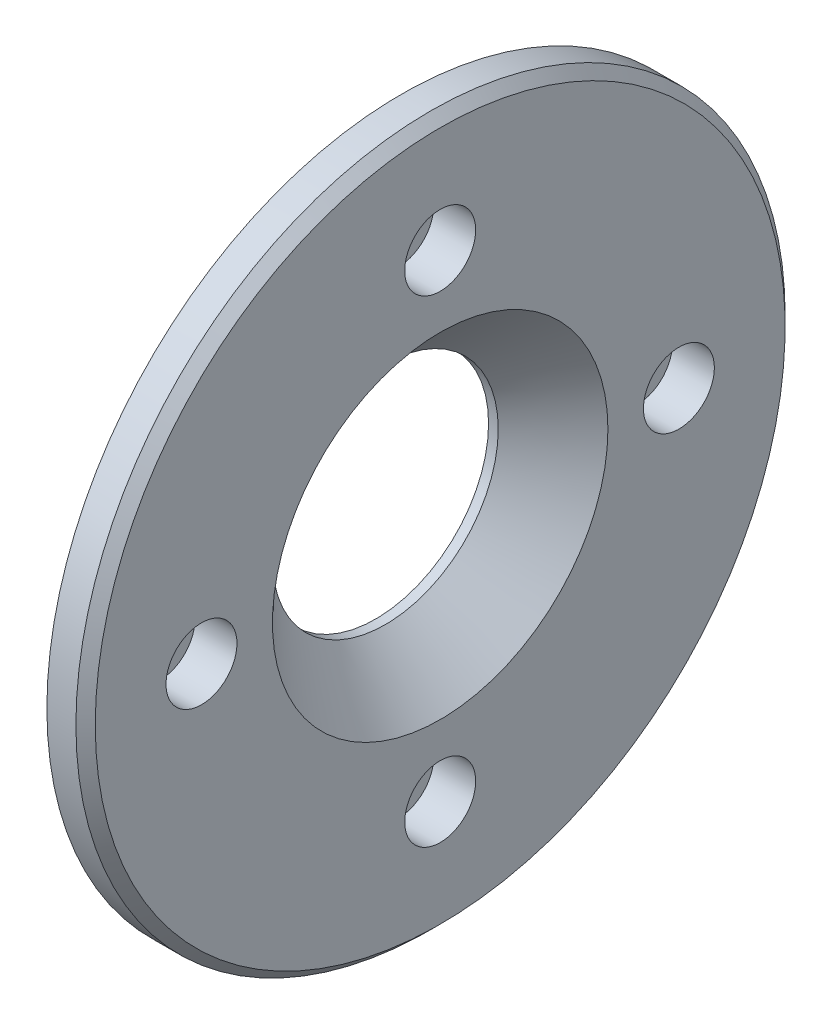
ISO-10303-21;
HEADER;
FILE_DESCRIPTION(('STEP AP214'),'2;1');
FILE_NAME('part.step','',(''),(''),'','','');
FILE_SCHEMA(('AUTOMOTIVE_DESIGN { 1 0 10303 214 1 1 1 1 }'));
ENDSEC;
DATA;
#1=APPLICATION_CONTEXT('core data for automotive mechanical design processes');
#2=APPLICATION_PROTOCOL_DEFINITION('international standard','automotive_design',2000,#1);
#3=PRODUCT_CONTEXT('',#1,'mechanical');
#4=PRODUCT('Part','Part','',(#3));
#5=PRODUCT_RELATED_PRODUCT_CATEGORY('part','',(#4));
#6=PRODUCT_DEFINITION_FORMATION('','',#4);
#7=PRODUCT_DEFINITION_CONTEXT('part definition',#1,'design');
#8=PRODUCT_DEFINITION('design','',#6,#7);
#9=PRODUCT_DEFINITION_SHAPE('','',#8);
#10=(LENGTH_UNIT() NAMED_UNIT(*) SI_UNIT(.MILLI.,.METRE.));
#11=(NAMED_UNIT(*) PLANE_ANGLE_UNIT() SI_UNIT($,.RADIAN.));
#12=(NAMED_UNIT(*) SI_UNIT($,.STERADIAN.) SOLID_ANGLE_UNIT());
#13=UNCERTAINTY_MEASURE_WITH_UNIT(LENGTH_MEASURE(1.E-05),#10,'distance_accuracy_value','');
#14=(GEOMETRIC_REPRESENTATION_CONTEXT(3) GLOBAL_UNCERTAINTY_ASSIGNED_CONTEXT((#13)) GLOBAL_UNIT_ASSIGNED_CONTEXT((#10,
#11,#12)) REPRESENTATION_CONTEXT('',''));
#15=CARTESIAN_POINT('',(0.,0.,0.));
#16=DIRECTION('',(0.,0.,1.));
#17=DIRECTION('',(1.,0.,0.));
#18=AXIS2_PLACEMENT_3D('',#15,#16,#17);
#19=CARTESIAN_POINT('',(1.99999999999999,0.,0.));
#20=DIRECTION('',(1.,0.,0.));
#21=DIRECTION('',(0.,0.,-1.));
#22=AXIS2_PLACEMENT_3D('',#19,#20,#21);
#23=CYLINDRICAL_SURFACE('',#22,44.9685);
#24=CARTESIAN_POINT('',(0.,0.,0.));
#25=DIRECTION('',(1.,0.,0.));
#26=DIRECTION('',(0.,0.,-1.));
#27=AXIS2_PLACEMENT_3D('',#24,#25,#26);
#28=CIRCLE('',#27,44.9685);
#29=CARTESIAN_POINT('',(0.,0.,-44.9685));
#30=VERTEX_POINT('',#29);
#31=EDGE_CURVE('E87',#30,#30,#28,.F.);
#32=ORIENTED_EDGE('',*,*,#31,.F.);
#33=EDGE_LOOP('',(#32));
#34=FACE_BOUND('',#33,.T.);
#35=CARTESIAN_POINT('',(3.99999999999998,0.,0.));
#36=DIRECTION('',(1.,0.,0.));
#37=DIRECTION('',(0.,0.,-1.));
#38=AXIS2_PLACEMENT_3D('',#35,#36,#37);
#39=CIRCLE('',#38,44.9685);
#40=CARTESIAN_POINT('',(3.99999999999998,0.,-44.9685));
#41=VERTEX_POINT('',#40);
#42=EDGE_CURVE('E18',#41,#41,#39,.T.);
#43=ORIENTED_EDGE('',*,*,#42,.F.);
#44=EDGE_LOOP('',(#43));
#45=FACE_BOUND('',#44,.T.);
#46=ADVANCED_FACE('F15',(#34,#45),#23,.T.);
#47=CARTESIAN_POINT('',(3.99999999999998,49.9685,0.));
#48=DIRECTION('',(-1.,0.,0.));
#49=DIRECTION('',(0.,0.,1.));
#50=AXIS2_PLACEMENT_3D('',#47,#48,#49);
#51=PLANE('',#50);
#52=ORIENTED_EDGE('',*,*,#42,.T.);
#53=EDGE_LOOP('',(#52));
#54=FACE_BOUND('',#53,.T.);
#55=CARTESIAN_POINT('',(3.99999999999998,0.,0.));
#56=DIRECTION('',(1.,0.,0.));
#57=DIRECTION('',(0.,0.,-1.));
#58=AXIS2_PLACEMENT_3D('',#55,#56,#57);
#59=CIRCLE('',#58,54.9685);
#60=CARTESIAN_POINT('',(3.99999999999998,0.,-54.9685));
#61=VERTEX_POINT('',#60);
#62=EDGE_CURVE('E73',#61,#61,#59,.T.);
#63=ORIENTED_EDGE('',*,*,#62,.F.);
#64=EDGE_LOOP('',(#63));
#65=FACE_BOUND('',#64,.T.);
#66=ADVANCED_FACE('F94',(#54,#65),#51,.T.);
#67=CARTESIAN_POINT('',(-145.795660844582,0.,37.));
#68=DIRECTION('',(1.,0.,0.));
#69=DIRECTION('',(0.,0.,-1.));
#70=AXIS2_PLACEMENT_3D('',#67,#68,#69);
#71=CYLINDRICAL_SURFACE('',#70,3.25);
#72=CARTESIAN_POINT('',(3.49999999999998,0.,37.));
#73=DIRECTION('',(1.,0.,0.));
#74=DIRECTION('',(0.,0.,-1.));
#75=AXIS2_PLACEMENT_3D('',#72,#73,#74);
#76=CIRCLE('',#75,3.25);
#77=CARTESIAN_POINT('',(3.49999999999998,0.,33.75));
#78=VERTEX_POINT('',#77);
#79=EDGE_CURVE('E70',#78,#78,#76,.F.);
#80=ORIENTED_EDGE('',*,*,#79,.F.);
#81=EDGE_LOOP('',(#80));
#82=FACE_BOUND('',#81,.T.);
#83=CARTESIAN_POINT('',(0.,0.,37.));
#84=DIRECTION('',(1.,0.,0.));
#85=DIRECTION('',(0.,0.,-1.));
#86=AXIS2_PLACEMENT_3D('',#83,#84,#85);
#87=CIRCLE('',#86,3.25);
#88=CARTESIAN_POINT('',(0.,0.,33.75));
#89=VERTEX_POINT('',#88);
#90=EDGE_CURVE('E85',#89,#89,#87,.T.);
#91=ORIENTED_EDGE('',*,*,#90,.F.);
#92=EDGE_LOOP('',(#91));
#93=FACE_BOUND('',#92,.T.);
#94=ADVANCED_FACE('F103',(#82,#93),#71,.F.);
#95=CARTESIAN_POINT('',(-145.795660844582,0.,-37.));
#96=DIRECTION('',(1.,0.,0.));
#97=DIRECTION('',(0.,0.,-1.));
#98=AXIS2_PLACEMENT_3D('',#95,#96,#97);
#99=CYLINDRICAL_SURFACE('',#98,3.25);
#100=CARTESIAN_POINT('',(3.49999999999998,0.,-37.));
#101=DIRECTION('',(1.,0.,0.));
#102=DIRECTION('',(0.,0.,-1.));
#103=AXIS2_PLACEMENT_3D('',#100,#101,#102);
#104=CIRCLE('',#103,3.25);
#105=CARTESIAN_POINT('',(3.49999999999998,0.,-40.25));
#106=VERTEX_POINT('',#105);
#107=EDGE_CURVE('E67',#106,#106,#104,.F.);
#108=ORIENTED_EDGE('',*,*,#107,.F.);
#109=EDGE_LOOP('',(#108));
#110=FACE_BOUND('',#109,.T.);
#111=CARTESIAN_POINT('',(0.,0.,-37.));
#112=DIRECTION('',(1.,0.,0.));
#113=DIRECTION('',(0.,0.,-1.));
#114=AXIS2_PLACEMENT_3D('',#111,#112,#113);
#115=CIRCLE('',#114,3.25);
#116=CARTESIAN_POINT('',(0.,0.,-40.25));
#117=VERTEX_POINT('',#116);
#118=EDGE_CURVE('E82',#117,#117,#115,.T.);
#119=ORIENTED_EDGE('',*,*,#118,.F.);
#120=EDGE_LOOP('',(#119));
#121=FACE_BOUND('',#120,.T.);
#122=ADVANCED_FACE('F170',(#110,#121),#99,.F.);
#123=CARTESIAN_POINT('',(-145.795660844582,-37.,0.));
#124=DIRECTION('',(1.,0.,0.));
#125=DIRECTION('',(0.,0.,-1.));
#126=AXIS2_PLACEMENT_3D('',#123,#124,#125);
#127=CYLINDRICAL_SURFACE('',#126,3.25);
#128=CARTESIAN_POINT('',(3.49999999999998,-37.,0.));
#129=DIRECTION('',(1.,0.,0.));
#130=DIRECTION('',(0.,0.,-1.));
#131=AXIS2_PLACEMENT_3D('',#128,#129,#130);
#132=CIRCLE('',#131,3.25);
#133=CARTESIAN_POINT('',(3.49999999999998,-37.,-3.25));
#134=VERTEX_POINT('',#133);
#135=EDGE_CURVE('E64',#134,#134,#132,.F.);
#136=ORIENTED_EDGE('',*,*,#135,.F.);
#137=EDGE_LOOP('',(#136));
#138=FACE_BOUND('',#137,.T.);
#139=CARTESIAN_POINT('',(0.,-37.,0.));
#140=DIRECTION('',(1.,0.,0.));
#141=DIRECTION('',(0.,0.,-1.));
#142=AXIS2_PLACEMENT_3D('',#139,#140,#141);
#143=CIRCLE('',#142,3.25);
#144=CARTESIAN_POINT('',(0.,-37.,-3.25));
#145=VERTEX_POINT('',#144);
#146=EDGE_CURVE('E79',#145,#145,#143,.T.);
#147=ORIENTED_EDGE('',*,*,#146,.F.);
#148=EDGE_LOOP('',(#147));
#149=FACE_BOUND('',#148,.T.);
#150=ADVANCED_FACE('F166',(#138,#149),#127,.F.);
#151=CARTESIAN_POINT('',(-145.795660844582,37.,0.));
#152=DIRECTION('',(1.,0.,0.));
#153=DIRECTION('',(0.,0.,-1.));
#154=AXIS2_PLACEMENT_3D('',#151,#152,#153);
#155=CYLINDRICAL_SURFACE('',#154,3.25);
#156=CARTESIAN_POINT('',(3.49999999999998,37.,0.));
#157=DIRECTION('',(1.,0.,0.));
#158=DIRECTION('',(0.,0.,-1.));
#159=AXIS2_PLACEMENT_3D('',#156,#157,#158);
#160=CIRCLE('',#159,3.25);
#161=CARTESIAN_POINT('',(3.49999999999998,37.,-3.25));
#162=VERTEX_POINT('',#161);
#163=EDGE_CURVE('E61',#162,#162,#160,.F.);
#164=ORIENTED_EDGE('',*,*,#163,.F.);
#165=EDGE_LOOP('',(#164));
#166=FACE_BOUND('',#165,.T.);
#167=CARTESIAN_POINT('',(0.,37.,0.));
#168=DIRECTION('',(1.,0.,0.));
#169=DIRECTION('',(0.,0.,-1.));
#170=AXIS2_PLACEMENT_3D('',#167,#168,#169);
#171=CIRCLE('',#170,3.25);
#172=CARTESIAN_POINT('',(0.,37.,-3.25));
#173=VERTEX_POINT('',#172);
#174=EDGE_CURVE('E76',#173,#173,#171,.T.);
#175=ORIENTED_EDGE('',*,*,#174,.F.);
#176=EDGE_LOOP('',(#175));
#177=FACE_BOUND('',#176,.T.);
#178=ADVANCED_FACE('F162',(#166,#177),#155,.F.);
#179=CARTESIAN_POINT('',(0.,31.23425,0.));
#180=DIRECTION('',(-1.,0.,0.));
#181=DIRECTION('',(0.,0.,1.));
#182=AXIS2_PLACEMENT_3D('',#179,#180,#181);
#183=PLANE('',#182);
#184=CARTESIAN_POINT('',(0.,0.,0.));
#185=DIRECTION('',(1.,0.,0.));
#186=DIRECTION('',(0.,0.,-1.));
#187=AXIS2_PLACEMENT_3D('',#184,#185,#186);
#188=CIRCLE('',#187,17.5);
#189=CARTESIAN_POINT('',(0.,0.,-17.5));
#190=VERTEX_POINT('',#189);
#191=EDGE_CURVE('E58',#190,#190,#188,.T.);
#192=ORIENTED_EDGE('',*,*,#191,.T.);
#193=EDGE_LOOP('',(#192));
#194=FACE_BOUND('',#193,.T.);
#195=ORIENTED_EDGE('',*,*,#174,.T.);
#196=EDGE_LOOP('',(#195));
#197=FACE_BOUND('',#196,.T.);
#198=ORIENTED_EDGE('',*,*,#146,.T.);
#199=EDGE_LOOP('',(#198));
#200=FACE_BOUND('',#199,.T.);
#201=ORIENTED_EDGE('',*,*,#118,.T.);
#202=EDGE_LOOP('',(#201));
#203=FACE_BOUND('',#202,.T.);
#204=ORIENTED_EDGE('',*,*,#90,.T.);
#205=EDGE_LOOP('',(#204));
#206=FACE_BOUND('',#205,.T.);
#207=ORIENTED_EDGE('',*,*,#31,.T.);
#208=EDGE_LOOP('',(#207));
#209=FACE_BOUND('',#208,.T.);
#210=ADVANCED_FACE('F158',(#194,#197,#200,#203,#206,#209),#183,.T.);
#211=CARTESIAN_POINT('',(6.24999999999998,0.,0.));
#212=DIRECTION('',(1.,0.,0.));
#213=DIRECTION('',(0.,0.,-1.));
#214=AXIS2_PLACEMENT_3D('',#211,#212,#213);
#215=CYLINDRICAL_SURFACE('',#214,54.9685);
#216=ORIENTED_EDGE('',*,*,#62,.T.);
#217=EDGE_LOOP('',(#216));
#218=FACE_BOUND('',#217,.T.);
#219=CARTESIAN_POINT('',(8.49999999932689,0.,0.));
#220=DIRECTION('',(-1.,0.,0.));
#221=DIRECTION('',(0.,1.,0.));
#222=AXIS2_PLACEMENT_3D('',#219,#220,#221);
#223=CIRCLE('',#222,54.9684999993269);
#224=CARTESIAN_POINT('',(8.49999999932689,54.9684999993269,0.));
#225=VERTEX_POINT('',#224);
#226=EDGE_CURVE('E57',#225,#225,#223,.F.);
#227=ORIENTED_EDGE('',*,*,#226,.F.);
#228=EDGE_LOOP('',(#227));
#229=FACE_BOUND('',#228,.T.);
#230=ADVANCED_FACE('F154',(#218,#229),#215,.T.);
#231=CARTESIAN_POINT('',(3.49999999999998,0.,37.));
#232=DIRECTION('',(1.,0.,0.));
#233=DIRECTION('',(0.,0.,-1.));
#234=AXIS2_PLACEMENT_3D('',#231,#232,#233);
#235=PLANE('',#234);
#236=ORIENTED_EDGE('',*,*,#79,.T.);
#237=EDGE_LOOP('',(#236));
#238=FACE_BOUND('',#237,.T.);
#239=CARTESIAN_POINT('',(3.49999999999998,0.,37.));
#240=DIRECTION('',(1.,0.,0.));
#241=DIRECTION('',(0.,0.,-1.));
#242=AXIS2_PLACEMENT_3D('',#239,#240,#241);
#243=CIRCLE('',#242,5.5);
#244=CARTESIAN_POINT('',(3.49999999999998,0.,31.5));
#245=VERTEX_POINT('',#244);
#246=EDGE_CURVE('E54',#245,#245,#243,.T.);
#247=ORIENTED_EDGE('',*,*,#246,.T.);
#248=EDGE_LOOP('',(#247));
#249=FACE_BOUND('',#248,.T.);
#250=ADVANCED_FACE('F150',(#238,#249),#235,.T.);
#251=CARTESIAN_POINT('',(3.49999999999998,0.,-37.));
#252=DIRECTION('',(1.,0.,0.));
#253=DIRECTION('',(0.,0.,-1.));
#254=AXIS2_PLACEMENT_3D('',#251,#252,#253);
#255=PLANE('',#254);
#256=ORIENTED_EDGE('',*,*,#107,.T.);
#257=EDGE_LOOP('',(#256));
#258=FACE_BOUND('',#257,.T.);
#259=CARTESIAN_POINT('',(3.49999999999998,0.,-37.));
#260=DIRECTION('',(1.,0.,0.));
#261=DIRECTION('',(0.,0.,-1.));
#262=AXIS2_PLACEMENT_3D('',#259,#260,#261);
#263=CIRCLE('',#262,5.5);
#264=CARTESIAN_POINT('',(3.49999999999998,0.,-42.5));
#265=VERTEX_POINT('',#264);
#266=EDGE_CURVE('E51',#265,#265,#263,.T.);
#267=ORIENTED_EDGE('',*,*,#266,.T.);
#268=EDGE_LOOP('',(#267));
#269=FACE_BOUND('',#268,.T.);
#270=ADVANCED_FACE('F146',(#258,#269),#255,.T.);
#271=CARTESIAN_POINT('',(3.49999999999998,-37.,0.));
#272=DIRECTION('',(1.,0.,0.));
#273=DIRECTION('',(0.,0.,-1.));
#274=AXIS2_PLACEMENT_3D('',#271,#272,#273);
#275=PLANE('',#274);
#276=ORIENTED_EDGE('',*,*,#135,.T.);
#277=EDGE_LOOP('',(#276));
#278=FACE_BOUND('',#277,.T.);
#279=CARTESIAN_POINT('',(3.49999999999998,-37.,0.));
#280=DIRECTION('',(1.,0.,0.));
#281=DIRECTION('',(0.,0.,-1.));
#282=AXIS2_PLACEMENT_3D('',#279,#280,#281);
#283=CIRCLE('',#282,5.5);
#284=CARTESIAN_POINT('',(3.49999999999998,-37.,-5.5));
#285=VERTEX_POINT('',#284);
#286=EDGE_CURVE('E48',#285,#285,#283,.T.);
#287=ORIENTED_EDGE('',*,*,#286,.T.);
#288=EDGE_LOOP('',(#287));
#289=FACE_BOUND('',#288,.T.);
#290=ADVANCED_FACE('F142',(#278,#289),#275,.T.);
#291=CARTESIAN_POINT('',(3.49999999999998,37.,0.));
#292=DIRECTION('',(1.,0.,0.));
#293=DIRECTION('',(0.,0.,-1.));
#294=AXIS2_PLACEMENT_3D('',#291,#292,#293);
#295=PLANE('',#294);
#296=ORIENTED_EDGE('',*,*,#163,.T.);
#297=EDGE_LOOP('',(#296));
#298=FACE_BOUND('',#297,.T.);
#299=CARTESIAN_POINT('',(3.49999999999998,37.,0.));
#300=DIRECTION('',(1.,0.,0.));
#301=DIRECTION('',(0.,0.,-1.));
#302=AXIS2_PLACEMENT_3D('',#299,#300,#301);
#303=CIRCLE('',#302,5.5);
#304=CARTESIAN_POINT('',(3.49999999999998,37.,-5.5));
#305=VERTEX_POINT('',#304);
#306=EDGE_CURVE('E45',#305,#305,#303,.T.);
#307=ORIENTED_EDGE('',*,*,#306,.T.);
#308=EDGE_LOOP('',(#307));
#309=FACE_BOUND('',#308,.T.);
#310=ADVANCED_FACE('F138',(#298,#309),#295,.T.);
#311=CARTESIAN_POINT('',(0.749999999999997,0.,0.));
#312=DIRECTION('',(1.,0.,0.));
#313=DIRECTION('',(0.,0.,-1.));
#314=AXIS2_PLACEMENT_3D('',#311,#312,#313);
#315=CYLINDRICAL_SURFACE('',#314,17.5);
#316=CARTESIAN_POINT('',(1.49999999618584,0.,0.));
#317=DIRECTION('',(1.,0.,0.));
#318=DIRECTION('',(0.,1.,0.));
#319=AXIS2_PLACEMENT_3D('',#316,#317,#318);
#320=CIRCLE('',#319,17.5000000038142);
#321=CARTESIAN_POINT('',(1.49999999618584,17.5000000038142,0.));
#322=VERTEX_POINT('',#321);
#323=EDGE_CURVE('E44',#322,#322,#320,.T.);
#324=ORIENTED_EDGE('',*,*,#323,.T.);
#325=EDGE_LOOP('',(#324));
#326=FACE_BOUND('',#325,.T.);
#327=ORIENTED_EDGE('',*,*,#191,.F.);
#328=EDGE_LOOP('',(#327));
#329=FACE_BOUND('',#328,.T.);
#330=ADVANCED_FACE('F134',(#326,#329),#315,.F.);
#331=CARTESIAN_POINT('',(8.49999999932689,0.,0.));
#332=DIRECTION('',(-1.,0.,0.));
#333=DIRECTION('',(0.,0.,1.));
#334=AXIS2_PLACEMENT_3D('',#331,#332,#333);
#335=CONICAL_SURFACE('',#334,54.9684999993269,0.785398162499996);
#336=ORIENTED_EDGE('',*,*,#226,.T.);
#337=EDGE_LOOP('',(#336));
#338=FACE_BOUND('',#337,.T.);
#339=CARTESIAN_POINT('',(10.0000000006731,0.,0.));
#340=DIRECTION('',(-1.,0.,0.));
#341=DIRECTION('',(0.,0.,1.));
#342=AXIS2_PLACEMENT_3D('',#339,#340,#341);
#343=CIRCLE('',#342,53.4685000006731);
#344=CARTESIAN_POINT('',(10.0000000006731,0.,53.4685000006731));
#345=VERTEX_POINT('',#344);
#346=EDGE_CURVE('E41',#345,#345,#343,.F.);
#347=ORIENTED_EDGE('',*,*,#346,.F.);
#348=EDGE_LOOP('',(#347));
#349=FACE_BOUND('',#348,.T.);
#350=ADVANCED_FACE('F130',(#338,#349),#335,.T.);
#351=CARTESIAN_POINT('',(6.74999999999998,0.,37.));
#352=DIRECTION('',(1.,0.,0.));
#353=DIRECTION('',(0.,0.,-1.));
#354=AXIS2_PLACEMENT_3D('',#351,#352,#353);
#355=CYLINDRICAL_SURFACE('',#354,5.5);
#356=ORIENTED_EDGE('',*,*,#246,.F.);
#357=EDGE_LOOP('',(#356));
#358=FACE_BOUND('',#357,.T.);
#359=CARTESIAN_POINT('',(9.99999999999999,0.,37.));
#360=DIRECTION('',(1.,0.,0.));
#361=DIRECTION('',(0.,0.,-1.));
#362=AXIS2_PLACEMENT_3D('',#359,#360,#361);
#363=CIRCLE('',#362,5.5);
#364=CARTESIAN_POINT('',(9.99999999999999,0.,31.5));
#365=VERTEX_POINT('',#364);
#366=EDGE_CURVE('E38',#365,#365,#363,.F.);
#367=ORIENTED_EDGE('',*,*,#366,.F.);
#368=EDGE_LOOP('',(#367));
#369=FACE_BOUND('',#368,.T.);
#370=ADVANCED_FACE('F126',(#358,#369),#355,.F.);
#371=CARTESIAN_POINT('',(6.74999999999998,0.,-37.));
#372=DIRECTION('',(1.,0.,0.));
#373=DIRECTION('',(0.,0.,-1.));
#374=AXIS2_PLACEMENT_3D('',#371,#372,#373);
#375=CYLINDRICAL_SURFACE('',#374,5.5);
#376=ORIENTED_EDGE('',*,*,#266,.F.);
#377=EDGE_LOOP('',(#376));
#378=FACE_BOUND('',#377,.T.);
#379=CARTESIAN_POINT('',(9.99999999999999,0.,-37.));
#380=DIRECTION('',(1.,0.,0.));
#381=DIRECTION('',(0.,0.,-1.));
#382=AXIS2_PLACEMENT_3D('',#379,#380,#381);
#383=CIRCLE('',#382,5.5);
#384=CARTESIAN_POINT('',(9.99999999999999,0.,-42.5));
#385=VERTEX_POINT('',#384);
#386=EDGE_CURVE('E35',#385,#385,#383,.F.);
#387=ORIENTED_EDGE('',*,*,#386,.F.);
#388=EDGE_LOOP('',(#387));
#389=FACE_BOUND('',#388,.T.);
#390=ADVANCED_FACE('F122',(#378,#389),#375,.F.);
#391=CARTESIAN_POINT('',(6.74999999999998,-37.,0.));
#392=DIRECTION('',(1.,0.,0.));
#393=DIRECTION('',(0.,0.,-1.));
#394=AXIS2_PLACEMENT_3D('',#391,#392,#393);
#395=CYLINDRICAL_SURFACE('',#394,5.5);
#396=ORIENTED_EDGE('',*,*,#286,.F.);
#397=EDGE_LOOP('',(#396));
#398=FACE_BOUND('',#397,.T.);
#399=CARTESIAN_POINT('',(9.99999999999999,-37.,0.));
#400=DIRECTION('',(1.,0.,0.));
#401=DIRECTION('',(0.,0.,-1.));
#402=AXIS2_PLACEMENT_3D('',#399,#400,#401);
#403=CIRCLE('',#402,5.5);
#404=CARTESIAN_POINT('',(9.99999999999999,-37.,-5.5));
#405=VERTEX_POINT('',#404);
#406=EDGE_CURVE('E27',#405,#405,#403,.F.);
#407=ORIENTED_EDGE('',*,*,#406,.F.);
#408=EDGE_LOOP('',(#407));
#409=FACE_BOUND('',#408,.T.);
#410=ADVANCED_FACE('F118',(#398,#409),#395,.F.);
#411=CARTESIAN_POINT('',(6.74999999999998,37.,0.));
#412=DIRECTION('',(1.,0.,0.));
#413=DIRECTION('',(0.,0.,-1.));
#414=AXIS2_PLACEMENT_3D('',#411,#412,#413);
#415=CYLINDRICAL_SURFACE('',#414,5.5);
#416=ORIENTED_EDGE('',*,*,#306,.F.);
#417=EDGE_LOOP('',(#416));
#418=FACE_BOUND('',#417,.T.);
#419=CARTESIAN_POINT('',(9.99999999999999,37.,0.));
#420=DIRECTION('',(1.,0.,0.));
#421=DIRECTION('',(0.,0.,-1.));
#422=AXIS2_PLACEMENT_3D('',#419,#420,#421);
#423=CIRCLE('',#422,5.5);
#424=CARTESIAN_POINT('',(9.99999999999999,37.,-5.5));
#425=VERTEX_POINT('',#424);
#426=EDGE_CURVE('E22',#425,#425,#423,.F.);
#427=ORIENTED_EDGE('',*,*,#426,.F.);
#428=EDGE_LOOP('',(#427));
#429=FACE_BOUND('',#428,.T.);
#430=ADVANCED_FACE('F111',(#418,#429),#415,.F.);
#431=CARTESIAN_POINT('',(10.0000000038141,0.,0.));
#432=DIRECTION('',(1.,0.,0.));
#433=DIRECTION('',(0.,0.,-1.));
#434=AXIS2_PLACEMENT_3D('',#431,#432,#433);
#435=CONICAL_SURFACE('',#434,25.9999999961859,0.7853981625);
#436=CARTESIAN_POINT('',(10.0000000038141,0.,0.));
#437=DIRECTION('',(1.,0.,0.));
#438=DIRECTION('',(0.,0.,-1.));
#439=AXIS2_PLACEMENT_3D('',#436,#437,#438);
#440=CIRCLE('',#439,25.9999999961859);
#441=CARTESIAN_POINT('',(10.0000000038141,0.,-25.9999999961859));
#442=VERTEX_POINT('',#441);
#443=EDGE_CURVE('E10',#442,#442,#440,.F.);
#444=ORIENTED_EDGE('',*,*,#443,.F.);
#445=EDGE_LOOP('',(#444));
#446=FACE_BOUND('',#445,.T.);
#447=ORIENTED_EDGE('',*,*,#323,.F.);
#448=EDGE_LOOP('',(#447));
#449=FACE_BOUND('',#448,.T.);
#450=ADVANCED_FACE('F106',(#446,#449),#435,.F.);
#451=CARTESIAN_POINT('',(9.99999999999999,39.73425,0.));
#452=DIRECTION('',(1.,0.,0.));
#453=DIRECTION('',(0.,0.,-1.));
#454=AXIS2_PLACEMENT_3D('',#451,#452,#453);
#455=PLANE('',#454);
#456=ORIENTED_EDGE('',*,*,#443,.T.);
#457=EDGE_LOOP('',(#456));
#458=FACE_BOUND('',#457,.T.);
#459=ORIENTED_EDGE('',*,*,#426,.T.);
#460=EDGE_LOOP('',(#459));
#461=FACE_BOUND('',#460,.T.);
#462=ORIENTED_EDGE('',*,*,#406,.T.);
#463=EDGE_LOOP('',(#462));
#464=FACE_BOUND('',#463,.T.);
#465=ORIENTED_EDGE('',*,*,#386,.T.);
#466=EDGE_LOOP('',(#465));
#467=FACE_BOUND('',#466,.T.);
#468=ORIENTED_EDGE('',*,*,#366,.T.);
#469=EDGE_LOOP('',(#468));
#470=FACE_BOUND('',#469,.T.);
#471=ORIENTED_EDGE('',*,*,#346,.T.);
#472=EDGE_LOOP('',(#471));
#473=FACE_BOUND('',#472,.T.);
#474=ADVANCED_FACE('F104',(#458,#461,#464,#467,#470,#473),#455,.T.);
#475=CLOSED_SHELL('',(#46,#66,#94,#122,#150,#178,#210,#230,#250,#270,#290,#310,#330,#350,#370,
#390,#410,#430,#450,#474));
#476=MANIFOLD_SOLID_BREP('B1',#475);
#477=ADVANCED_BREP_SHAPE_REPRESENTATION('',(#18,#476),#14);
#478=SHAPE_DEFINITION_REPRESENTATION(#9,#477);
ENDSEC;
END-ISO-10303-21;
